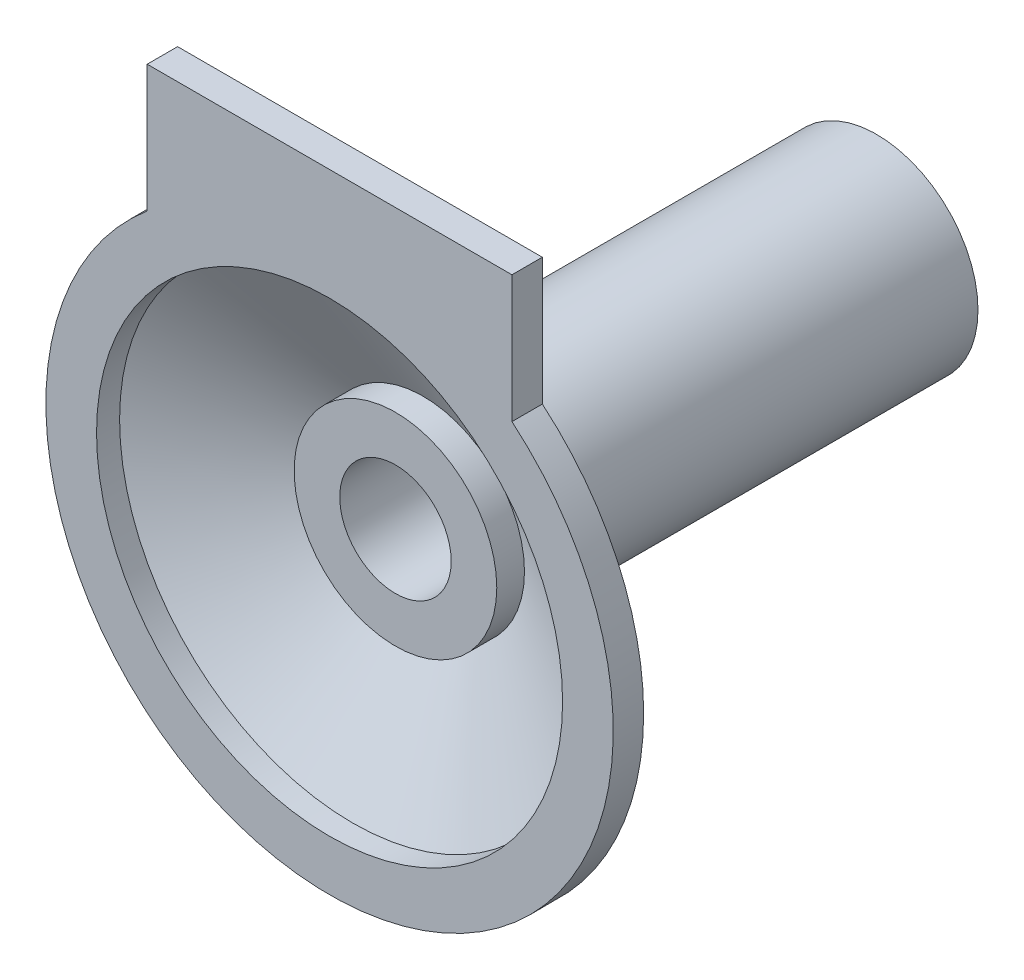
ISO-10303-21;
HEADER;
FILE_DESCRIPTION(('STEP AP214'),'2;1');
FILE_NAME('part.step','',(''),(''),'','','');
FILE_SCHEMA(('AUTOMOTIVE_DESIGN { 1 0 10303 214 1 1 1 1 }'));
ENDSEC;
DATA;
#1=APPLICATION_CONTEXT('core data for automotive mechanical design processes');
#2=APPLICATION_PROTOCOL_DEFINITION('international standard','automotive_design',2000,#1);
#3=PRODUCT_CONTEXT('',#1,'mechanical');
#4=PRODUCT('Part','Part','',(#3));
#5=PRODUCT_RELATED_PRODUCT_CATEGORY('part','',(#4));
#6=PRODUCT_DEFINITION_FORMATION('','',#4);
#7=PRODUCT_DEFINITION_CONTEXT('part definition',#1,'design');
#8=PRODUCT_DEFINITION('design','',#6,#7);
#9=PRODUCT_DEFINITION_SHAPE('','',#8);
#10=(LENGTH_UNIT() NAMED_UNIT(*) SI_UNIT(.MILLI.,.METRE.));
#11=(NAMED_UNIT(*) PLANE_ANGLE_UNIT() SI_UNIT($,.RADIAN.));
#12=(NAMED_UNIT(*) SI_UNIT($,.STERADIAN.) SOLID_ANGLE_UNIT());
#13=UNCERTAINTY_MEASURE_WITH_UNIT(LENGTH_MEASURE(1.E-05),#10,'distance_accuracy_value','');
#14=(GEOMETRIC_REPRESENTATION_CONTEXT(3) GLOBAL_UNCERTAINTY_ASSIGNED_CONTEXT((#13)) GLOBAL_UNIT_ASSIGNED_CONTEXT((#10,
#11,#12)) REPRESENTATION_CONTEXT('',''));
#15=CARTESIAN_POINT('',(0.,0.,0.));
#16=DIRECTION('',(0.,0.,1.));
#17=DIRECTION('',(1.,0.,0.));
#18=AXIS2_PLACEMENT_3D('',#15,#16,#17);
#19=CARTESIAN_POINT('',(0.,0.,0.));
#20=DIRECTION('',(0.,0.,1.));
#21=DIRECTION('',(1.,0.,0.));
#22=AXIS2_PLACEMENT_3D('',#19,#20,#21);
#23=CYLINDRICAL_SURFACE('',#22,73.025);
#24=CARTESIAN_POINT('',(0.,0.,0.));
#25=DIRECTION('',(0.,0.,1.));
#26=DIRECTION('',(1.,0.,0.));
#27=AXIS2_PLACEMENT_3D('',#24,#25,#26);
#28=CIRCLE('',#27,73.025);
#29=CARTESIAN_POINT('',(73.025,0.,0.));
#30=VERTEX_POINT('',#29);
#31=EDGE_CURVE('E11',#30,#30,#28,.T.);
#32=ORIENTED_EDGE('',*,*,#31,.T.);
#33=EDGE_LOOP('',(#32));
#34=FACE_BOUND('',#33,.T.);
#35=CARTESIAN_POINT('',(0.,0.,-7.22377348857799));
#36=DIRECTION('',(0.,0.,1.));
#37=DIRECTION('',(1.,0.,0.));
#38=AXIS2_PLACEMENT_3D('',#35,#36,#37);
#39=CIRCLE('',#38,73.025);
#40=CARTESIAN_POINT('',(73.025,0.,-7.22377348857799));
#41=VERTEX_POINT('',#40);
#42=EDGE_CURVE('E106',#41,#41,#39,.T.);
#43=ORIENTED_EDGE('',*,*,#42,.F.);
#44=EDGE_LOOP('',(#43));
#45=FACE_BOUND('',#44,.T.);
#46=ADVANCED_FACE('F31',(#34,#45),#23,.F.);
#47=CARTESIAN_POINT('',(0.,-73.025,0.));
#48=DIRECTION('',(0.,0.,1.));
#49=DIRECTION('',(1.,0.,0.));
#50=AXIS2_PLACEMENT_3D('',#47,#48,#49);
#51=PLANE('',#50);
#52=CARTESIAN_POINT('',(0.,0.,0.));
#53=DIRECTION('',(0.,0.,1.));
#54=DIRECTION('',(1.,0.,0.));
#55=AXIS2_PLACEMENT_3D('',#52,#53,#54);
#56=CIRCLE('',#55,88.9);
#57=CARTESIAN_POINT('',(-57.15,68.0961636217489,0.));
#58=VERTEX_POINT('',#57);
#59=CARTESIAN_POINT('',(57.15,68.0961636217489,0.));
#60=VERTEX_POINT('',#59);
#61=EDGE_CURVE('E38',#58,#60,#56,.T.);
#62=ORIENTED_EDGE('',*,*,#61,.T.);
#63=DIRECTION('',(0.,1.,0.));
#64=VECTOR('',#63,1.);
#65=CARTESIAN_POINT('',(57.15,68.0961636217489,0.));
#66=LINE('',#65,#64);
#67=CARTESIAN_POINT('',(57.15,107.95,0.));
#68=VERTEX_POINT('',#67);
#69=EDGE_CURVE('E97',#60,#68,#66,.T.);
#70=ORIENTED_EDGE('',*,*,#69,.T.);
#71=DIRECTION('',(-1.,0.,0.));
#72=VECTOR('',#71,1.);
#73=CARTESIAN_POINT('',(-57.15,107.95,0.));
#74=LINE('',#73,#72);
#75=CARTESIAN_POINT('',(-57.15,107.95,0.));
#76=VERTEX_POINT('',#75);
#77=EDGE_CURVE('E93',#68,#76,#74,.T.);
#78=ORIENTED_EDGE('',*,*,#77,.T.);
#79=DIRECTION('',(0.,-1.,0.));
#80=VECTOR('',#79,1.);
#81=CARTESIAN_POINT('',(-57.15,68.0961636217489,0.));
#82=LINE('',#81,#80);
#83=EDGE_CURVE('E101',#76,#58,#82,.T.);
#84=ORIENTED_EDGE('',*,*,#83,.T.);
#85=EDGE_LOOP('',(#62,#70,#78,#84));
#86=FACE_BOUND('',#85,.T.);
#87=ORIENTED_EDGE('',*,*,#31,.F.);
#88=EDGE_LOOP('',(#87));
#89=FACE_BOUND('',#88,.T.);
#90=ADVANCED_FACE('F142',(#86,#89),#51,.T.);
#91=CARTESIAN_POINT('',(0.,0.,0.));
#92=DIRECTION('',(0.,0.,1.));
#93=DIRECTION('',(1.,0.,0.));
#94=AXIS2_PLACEMENT_3D('',#91,#92,#93);
#95=CYLINDRICAL_SURFACE('',#94,88.9);
#96=DIRECTION('',(0.,0.,1.));
#97=VECTOR('',#96,1.);
#98=CARTESIAN_POINT('',(57.15,68.0961636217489,-9.525));
#99=LINE('',#98,#97);
#100=CARTESIAN_POINT('',(57.15,68.0961636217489,-9.525));
#101=VERTEX_POINT('',#100);
#102=EDGE_CURVE('E49',#101,#60,#99,.T.);
#103=ORIENTED_EDGE('',*,*,#102,.T.);
#104=ORIENTED_EDGE('',*,*,#61,.F.);
#105=DIRECTION('',(0.,0.,1.));
#106=VECTOR('',#105,1.);
#107=CARTESIAN_POINT('',(-57.15,68.0961636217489,-9.525));
#108=LINE('',#107,#106);
#109=CARTESIAN_POINT('',(-57.15,68.0961636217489,-9.525));
#110=VERTEX_POINT('',#109);
#111=EDGE_CURVE('E74',#110,#58,#108,.T.);
#112=ORIENTED_EDGE('',*,*,#111,.F.);
#113=CARTESIAN_POINT('',(0.,0.,-9.525));
#114=DIRECTION('',(0.,0.,1.));
#115=DIRECTION('',(1.,0.,0.));
#116=AXIS2_PLACEMENT_3D('',#113,#114,#115);
#117=CIRCLE('',#116,88.9);
#118=EDGE_CURVE('E68',#110,#101,#117,.T.);
#119=ORIENTED_EDGE('',*,*,#118,.T.);
#120=EDGE_LOOP('',(#103,#104,#112,#119));
#121=FACE_BOUND('',#120,.T.);
#122=ADVANCED_FACE('F75',(#121),#95,.T.);
#123=CARTESIAN_POINT('',(0.,0.,-9.525));
#124=DIRECTION('',(0.,0.,1.));
#125=DIRECTION('',(1.,0.,0.));
#126=AXIS2_PLACEMENT_3D('',#123,#124,#125);
#127=CONICAL_SURFACE('',#126,88.9,1.0789871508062);
#128=CARTESIAN_POINT('',(0.,0.,-40.1410714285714));
#129=DIRECTION('',(0.,0.,1.));
#130=DIRECTION('',(1.,0.,0.));
#131=AXIS2_PLACEMENT_3D('',#128,#129,#130);
#132=CIRCLE('',#131,31.75);
#133=CARTESIAN_POINT('',(31.75,0.,-40.1410714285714));
#134=VERTEX_POINT('',#133);
#135=EDGE_CURVE('E72',#134,#134,#132,.T.);
#136=ORIENTED_EDGE('',*,*,#135,.T.);
#137=EDGE_LOOP('',(#136));
#138=FACE_BOUND('',#137,.T.);
#139=EDGE_CURVE('E71',#101,#110,#117,.T.);
#140=ORIENTED_EDGE('',*,*,#139,.F.);
#141=ORIENTED_EDGE('',*,*,#118,.F.);
#142=EDGE_LOOP('',(#140,#141));
#143=FACE_BOUND('',#142,.T.);
#144=ADVANCED_FACE('F69',(#138,#143),#127,.T.);
#145=CARTESIAN_POINT('',(0.,0.,0.));
#146=DIRECTION('',(0.,0.,1.));
#147=DIRECTION('',(1.,0.,0.));
#148=AXIS2_PLACEMENT_3D('',#145,#146,#147);
#149=CYLINDRICAL_SURFACE('',#148,31.75);
#150=CARTESIAN_POINT('',(0.,0.,-171.45));
#151=DIRECTION('',(0.,0.,1.));
#152=DIRECTION('',(1.,0.,0.));
#153=AXIS2_PLACEMENT_3D('',#150,#151,#152);
#154=CIRCLE('',#153,31.75);
#155=CARTESIAN_POINT('',(31.75,0.,-171.45));
#156=VERTEX_POINT('',#155);
#157=EDGE_CURVE('E136',#156,#156,#154,.T.);
#158=ORIENTED_EDGE('',*,*,#157,.T.);
#159=EDGE_LOOP('',(#158));
#160=FACE_BOUND('',#159,.T.);
#161=ORIENTED_EDGE('',*,*,#135,.F.);
#162=EDGE_LOOP('',(#161));
#163=FACE_BOUND('',#162,.T.);
#164=ADVANCED_FACE('F218',(#160,#163),#149,.T.);
#165=CARTESIAN_POINT('',(0.,-31.75,-171.45));
#166=DIRECTION('',(0.,0.,-1.));
#167=DIRECTION('',(-1.,0.,0.));
#168=AXIS2_PLACEMENT_3D('',#165,#166,#167);
#169=PLANE('',#168);
#170=CARTESIAN_POINT('',(0.,0.,-171.45));
#171=DIRECTION('',(0.,0.,1.));
#172=DIRECTION('',(1.,0.,0.));
#173=AXIS2_PLACEMENT_3D('',#170,#171,#172);
#174=CIRCLE('',#173,17.4625);
#175=CARTESIAN_POINT('',(17.4625,0.,-171.45));
#176=VERTEX_POINT('',#175);
#177=EDGE_CURVE('E133',#176,#176,#174,.T.);
#178=ORIENTED_EDGE('',*,*,#177,.T.);
#179=EDGE_LOOP('',(#178));
#180=FACE_BOUND('',#179,.T.);
#181=ORIENTED_EDGE('',*,*,#157,.F.);
#182=EDGE_LOOP('',(#181));
#183=FACE_BOUND('',#182,.T.);
#184=ADVANCED_FACE('F212',(#180,#183),#169,.T.);
#185=CARTESIAN_POINT('',(0.,0.,0.));
#186=DIRECTION('',(0.,0.,1.));
#187=DIRECTION('',(1.,0.,0.));
#188=AXIS2_PLACEMENT_3D('',#185,#186,#187);
#189=CYLINDRICAL_SURFACE('',#188,17.4625);
#190=CARTESIAN_POINT('',(0.,0.,-120.65));
#191=DIRECTION('',(0.,0.,1.));
#192=DIRECTION('',(1.,0.,0.));
#193=AXIS2_PLACEMENT_3D('',#190,#191,#192);
#194=CIRCLE('',#193,17.4625);
#195=CARTESIAN_POINT('',(17.4625,0.,-120.65));
#196=VERTEX_POINT('',#195);
#197=EDGE_CURVE('E130',#196,#196,#194,.T.);
#198=ORIENTED_EDGE('',*,*,#197,.T.);
#199=EDGE_LOOP('',(#198));
#200=FACE_BOUND('',#199,.T.);
#201=ORIENTED_EDGE('',*,*,#177,.F.);
#202=EDGE_LOOP('',(#201));
#203=FACE_BOUND('',#202,.T.);
#204=ADVANCED_FACE('F206',(#200,#203),#189,.F.);
#205=CARTESIAN_POINT('',(0.,-17.4625,-120.65));
#206=DIRECTION('',(0.,0.,1.));
#207=DIRECTION('',(1.,0.,0.));
#208=AXIS2_PLACEMENT_3D('',#205,#206,#207);
#209=PLANE('',#208);
#210=CARTESIAN_POINT('',(0.,0.,-120.65));
#211=DIRECTION('',(0.,0.,1.));
#212=DIRECTION('',(1.,0.,0.));
#213=AXIS2_PLACEMENT_3D('',#210,#211,#212);
#214=CIRCLE('',#213,20.6375);
#215=CARTESIAN_POINT('',(20.6375,0.,-120.65));
#216=VERTEX_POINT('',#215);
#217=EDGE_CURVE('E127',#216,#216,#214,.T.);
#218=ORIENTED_EDGE('',*,*,#217,.T.);
#219=EDGE_LOOP('',(#218));
#220=FACE_BOUND('',#219,.T.);
#221=ORIENTED_EDGE('',*,*,#197,.F.);
#222=EDGE_LOOP('',(#221));
#223=FACE_BOUND('',#222,.T.);
#224=ADVANCED_FACE('F200',(#220,#223),#209,.T.);
#225=CARTESIAN_POINT('',(0.,0.,0.));
#226=DIRECTION('',(0.,0.,1.));
#227=DIRECTION('',(1.,0.,0.));
#228=AXIS2_PLACEMENT_3D('',#225,#226,#227);
#229=CYLINDRICAL_SURFACE('',#228,20.6375);
#230=CARTESIAN_POINT('',(0.,0.,-69.85));
#231=DIRECTION('',(0.,0.,1.));
#232=DIRECTION('',(1.,0.,0.));
#233=AXIS2_PLACEMENT_3D('',#230,#231,#232);
#234=CIRCLE('',#233,20.6375);
#235=CARTESIAN_POINT('',(20.6375,0.,-69.85));
#236=VERTEX_POINT('',#235);
#237=EDGE_CURVE('E124',#236,#236,#234,.T.);
#238=ORIENTED_EDGE('',*,*,#237,.T.);
#239=EDGE_LOOP('',(#238));
#240=FACE_BOUND('',#239,.T.);
#241=ORIENTED_EDGE('',*,*,#217,.F.);
#242=EDGE_LOOP('',(#241));
#243=FACE_BOUND('',#242,.T.);
#244=ADVANCED_FACE('F194',(#240,#243),#229,.F.);
#245=CARTESIAN_POINT('',(0.,-20.6375,-69.85));
#246=DIRECTION('',(0.,0.,-1.));
#247=DIRECTION('',(-1.,0.,0.));
#248=AXIS2_PLACEMENT_3D('',#245,#246,#247);
#249=PLANE('',#248);
#250=CARTESIAN_POINT('',(0.,0.,-69.85));
#251=DIRECTION('',(0.,0.,1.));
#252=DIRECTION('',(1.,0.,0.));
#253=AXIS2_PLACEMENT_3D('',#250,#251,#252);
#254=CIRCLE('',#253,17.4625);
#255=CARTESIAN_POINT('',(17.4625,0.,-69.85));
#256=VERTEX_POINT('',#255);
#257=EDGE_CURVE('E121',#256,#256,#254,.T.);
#258=ORIENTED_EDGE('',*,*,#257,.T.);
#259=EDGE_LOOP('',(#258));
#260=FACE_BOUND('',#259,.T.);
#261=ORIENTED_EDGE('',*,*,#237,.F.);
#262=EDGE_LOOP('',(#261));
#263=FACE_BOUND('',#262,.T.);
#264=ADVANCED_FACE('F188',(#260,#263),#249,.T.);
#265=CARTESIAN_POINT('',(0.,0.,0.));
#266=DIRECTION('',(0.,0.,1.));
#267=DIRECTION('',(1.,0.,0.));
#268=AXIS2_PLACEMENT_3D('',#265,#266,#267);
#269=CYLINDRICAL_SURFACE('',#268,17.4625);
#270=CARTESIAN_POINT('',(0.,0.,-20.6502));
#271=DIRECTION('',(0.,0.,1.));
#272=DIRECTION('',(1.,0.,0.));
#273=AXIS2_PLACEMENT_3D('',#270,#271,#272);
#274=CIRCLE('',#273,17.4625);
#275=CARTESIAN_POINT('',(17.4625,0.,-20.6502));
#276=VERTEX_POINT('',#275);
#277=EDGE_CURVE('E118',#276,#276,#274,.T.);
#278=ORIENTED_EDGE('',*,*,#277,.T.);
#279=EDGE_LOOP('',(#278));
#280=FACE_BOUND('',#279,.T.);
#281=ORIENTED_EDGE('',*,*,#257,.F.);
#282=EDGE_LOOP('',(#281));
#283=FACE_BOUND('',#282,.T.);
#284=ADVANCED_FACE('F182',(#280,#283),#269,.F.);
#285=CARTESIAN_POINT('',(0.,-17.4625,-20.6502));
#286=DIRECTION('',(0.,0.,1.));
#287=DIRECTION('',(1.,0.,0.));
#288=AXIS2_PLACEMENT_3D('',#285,#286,#287);
#289=PLANE('',#288);
#290=CARTESIAN_POINT('',(0.,0.,-20.6502));
#291=DIRECTION('',(0.,0.,1.));
#292=DIRECTION('',(1.,0.,0.));
#293=AXIS2_PLACEMENT_3D('',#290,#291,#292);
#294=CIRCLE('',#293,31.75);
#295=CARTESIAN_POINT('',(31.75,0.,-20.6502));
#296=VERTEX_POINT('',#295);
#297=EDGE_CURVE('E115',#296,#296,#294,.T.);
#298=ORIENTED_EDGE('',*,*,#297,.T.);
#299=EDGE_LOOP('',(#298));
#300=FACE_BOUND('',#299,.T.);
#301=ORIENTED_EDGE('',*,*,#277,.F.);
#302=EDGE_LOOP('',(#301));
#303=FACE_BOUND('',#302,.T.);
#304=ADVANCED_FACE('F176',(#300,#303),#289,.T.);
#305=CARTESIAN_POINT('',(0.,0.,0.));
#306=DIRECTION('',(0.,0.,1.));
#307=DIRECTION('',(1.,0.,0.));
#308=AXIS2_PLACEMENT_3D('',#305,#306,#307);
#309=CYLINDRICAL_SURFACE('',#308,31.75);
#310=CARTESIAN_POINT('',(0.,0.,-29.3353806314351));
#311=DIRECTION('',(0.,0.,1.));
#312=DIRECTION('',(1.,0.,0.));
#313=AXIS2_PLACEMENT_3D('',#310,#311,#312);
#314=CIRCLE('',#313,31.75);
#315=CARTESIAN_POINT('',(31.75,0.,-29.3353806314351));
#316=VERTEX_POINT('',#315);
#317=EDGE_CURVE('E112',#316,#316,#314,.T.);
#318=ORIENTED_EDGE('',*,*,#317,.T.);
#319=EDGE_LOOP('',(#318));
#320=FACE_BOUND('',#319,.T.);
#321=ORIENTED_EDGE('',*,*,#297,.F.);
#322=EDGE_LOOP('',(#321));
#323=FACE_BOUND('',#322,.T.);
#324=ADVANCED_FACE('F170',(#320,#323),#309,.T.);
#325=CARTESIAN_POINT('',(0.,0.,-29.3353806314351));
#326=DIRECTION('',(0.,0.,1.));
#327=DIRECTION('',(1.,0.,0.));
#328=AXIS2_PLACEMENT_3D('',#325,#326,#327);
#329=CONICAL_SURFACE('',#328,31.75,1.0789871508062);
#330=ORIENTED_EDGE('',*,*,#42,.T.);
#331=EDGE_LOOP('',(#330));
#332=FACE_BOUND('',#331,.T.);
#333=ORIENTED_EDGE('',*,*,#317,.F.);
#334=EDGE_LOOP('',(#333));
#335=FACE_BOUND('',#334,.T.);
#336=ADVANCED_FACE('F156',(#332,#335),#329,.F.);
#337=CARTESIAN_POINT('',(-57.15,68.0961636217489,-9.525));
#338=DIRECTION('',(-1.,0.,0.));
#339=DIRECTION('',(0.,0.,1.));
#340=AXIS2_PLACEMENT_3D('',#337,#338,#339);
#341=PLANE('',#340);
#342=ORIENTED_EDGE('',*,*,#83,.F.);
#343=DIRECTION('',(0.,0.,1.));
#344=VECTOR('',#343,1.);
#345=CARTESIAN_POINT('',(-57.15,107.95,-9.525));
#346=LINE('',#345,#344);
#347=CARTESIAN_POINT('',(-57.15,107.95,-9.525));
#348=VERTEX_POINT('',#347);
#349=EDGE_CURVE('E92',#348,#76,#346,.T.);
#350=ORIENTED_EDGE('',*,*,#349,.F.);
#351=DIRECTION('',(0.,-1.,0.));
#352=VECTOR('',#351,1.);
#353=CARTESIAN_POINT('',(-57.15,68.0961636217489,-9.525));
#354=LINE('',#353,#352);
#355=EDGE_CURVE('E87',#348,#110,#354,.T.);
#356=ORIENTED_EDGE('',*,*,#355,.T.);
#357=ORIENTED_EDGE('',*,*,#111,.T.);
#358=EDGE_LOOP('',(#342,#350,#356,#357));
#359=FACE_BOUND('',#358,.T.);
#360=ADVANCED_FACE('F91',(#359),#341,.T.);
#361=CARTESIAN_POINT('',(-57.15,107.95,-9.525));
#362=DIRECTION('',(0.,1.,0.));
#363=DIRECTION('',(0.,0.,1.));
#364=AXIS2_PLACEMENT_3D('',#361,#362,#363);
#365=PLANE('',#364);
#366=ORIENTED_EDGE('',*,*,#77,.F.);
#367=DIRECTION('',(0.,0.,1.));
#368=VECTOR('',#367,1.);
#369=CARTESIAN_POINT('',(57.15,107.95,-9.525));
#370=LINE('',#369,#368);
#371=CARTESIAN_POINT('',(57.15,107.95,-9.525));
#372=VERTEX_POINT('',#371);
#373=EDGE_CURVE('E107',#372,#68,#370,.T.);
#374=ORIENTED_EDGE('',*,*,#373,.F.);
#375=DIRECTION('',(-1.,0.,0.));
#376=VECTOR('',#375,1.);
#377=CARTESIAN_POINT('',(-57.15,107.95,-9.525));
#378=LINE('',#377,#376);
#379=EDGE_CURVE('E80',#372,#348,#378,.T.);
#380=ORIENTED_EDGE('',*,*,#379,.T.);
#381=ORIENTED_EDGE('',*,*,#349,.T.);
#382=EDGE_LOOP('',(#366,#374,#380,#381));
#383=FACE_BOUND('',#382,.T.);
#384=ADVANCED_FACE('F148',(#383),#365,.T.);
#385=CARTESIAN_POINT('',(57.15,68.0961636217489,-9.525));
#386=DIRECTION('',(1.,0.,0.));
#387=DIRECTION('',(0.,0.,-1.));
#388=AXIS2_PLACEMENT_3D('',#385,#386,#387);
#389=PLANE('',#388);
#390=ORIENTED_EDGE('',*,*,#69,.F.);
#391=ORIENTED_EDGE('',*,*,#102,.F.);
#392=DIRECTION('',(0.,1.,0.));
#393=VECTOR('',#392,1.);
#394=CARTESIAN_POINT('',(57.15,68.0961636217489,-9.525));
#395=LINE('',#394,#393);
#396=EDGE_CURVE('E90',#101,#372,#395,.T.);
#397=ORIENTED_EDGE('',*,*,#396,.T.);
#398=ORIENTED_EDGE('',*,*,#373,.T.);
#399=EDGE_LOOP('',(#390,#391,#397,#398));
#400=FACE_BOUND('',#399,.T.);
#401=ADVANCED_FACE('F146',(#400),#389,.T.);
#402=CARTESIAN_POINT('',(0.,0.,-9.525));
#403=DIRECTION('',(0.,0.,1.));
#404=DIRECTION('',(1.,0.,0.));
#405=AXIS2_PLACEMENT_3D('',#402,#403,#404);
#406=PLANE('',#405);
#407=ORIENTED_EDGE('',*,*,#139,.T.);
#408=ORIENTED_EDGE('',*,*,#355,.F.);
#409=ORIENTED_EDGE('',*,*,#379,.F.);
#410=ORIENTED_EDGE('',*,*,#396,.F.);
#411=EDGE_LOOP('',(#407,#408,#409,#410));
#412=FACE_BOUND('',#411,.T.);
#413=ADVANCED_FACE('F85',(#412),#406,.F.);
#414=CLOSED_SHELL('',(#46,#90,#122,#144,#164,#184,#204,#224,#244,#264,#284,#304,#324,#336,#360,
#384,#401,#413));
#415=MANIFOLD_SOLID_BREP('B2',#414);
#416=ADVANCED_BREP_SHAPE_REPRESENTATION('',(#18,#415),#14);
#417=SHAPE_DEFINITION_REPRESENTATION(#9,#416);
ENDSEC;
END-ISO-10303-21;
